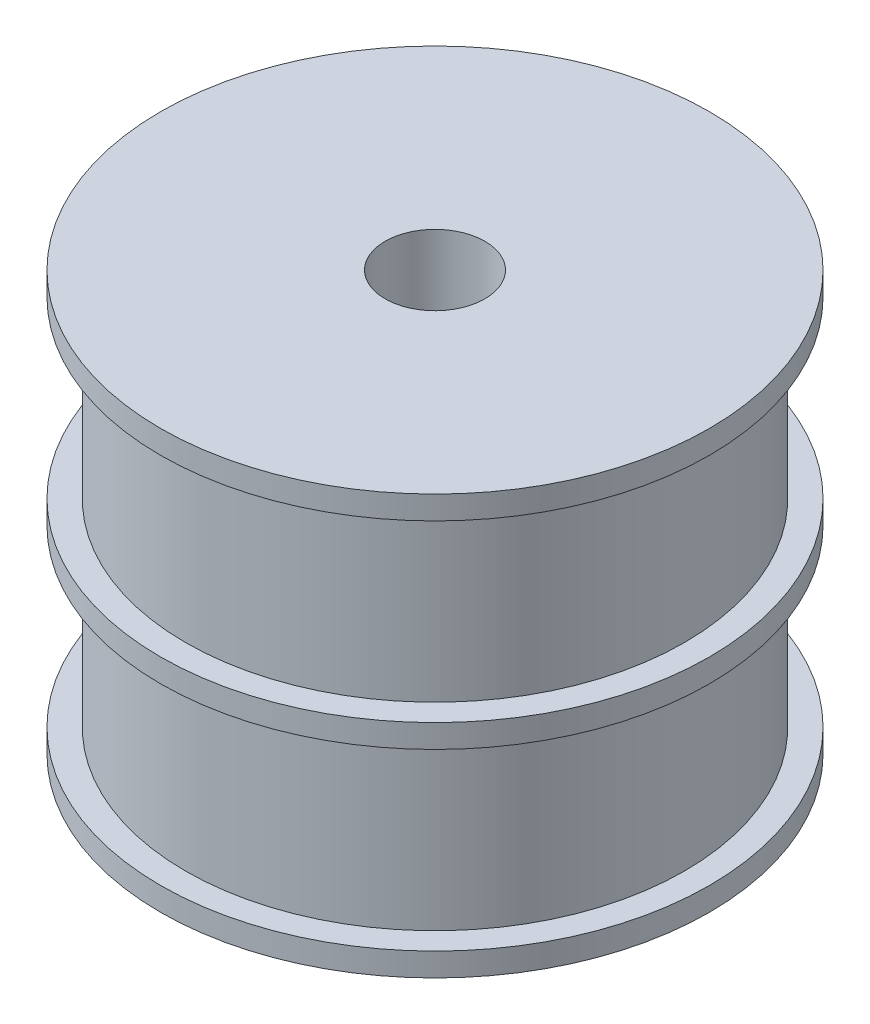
from build123d import *


with BuildPart() as part:
    # Sketch1 → Revolve1 (revolve)
    with BuildSketch(Plane.XY, mode=Mode.PRIVATE) as revolve1_sk:
        Polygon((1, 8.4), (1, 0), (5.5, 0), (5.5, 0.466666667), (5, 0.466666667), (5, 3.966666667), (5.5, 3.966666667), (5.5, 4.433333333), (5, 4.433333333), (5, 7.933333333), (5.5, 7.933333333), (5.5, 8.4), align=None)
    revolve(revolve1_sk.sketch.rotate(Axis((0, 0, 0), (0, 1, 0)), 90), axis=Axis((0, 0, 0), (0, 1, 0)))


solid = part.part
